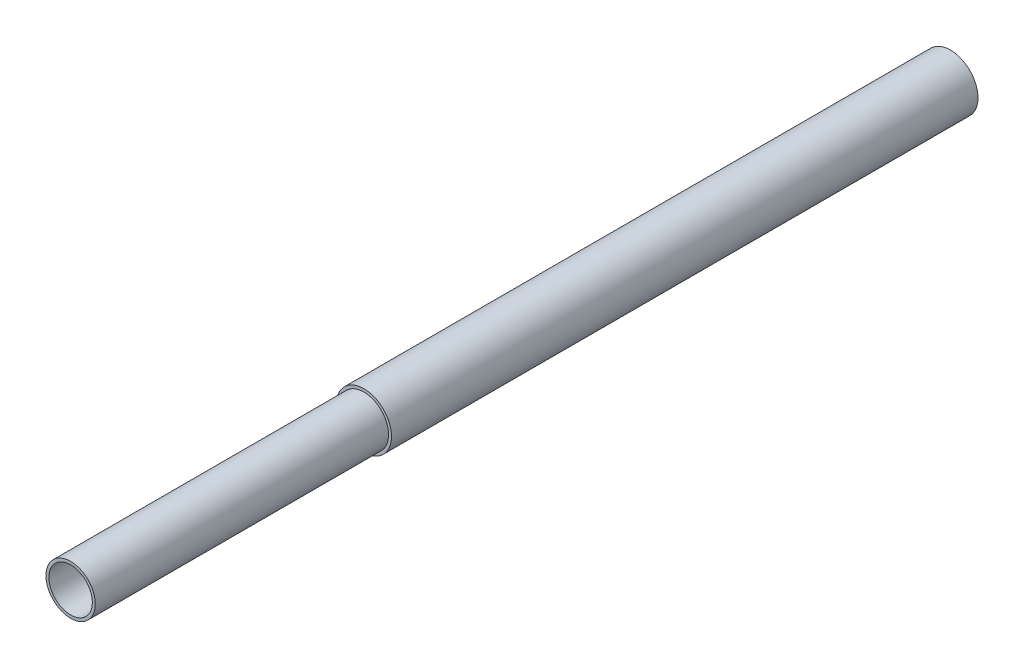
ISO-10303-21;
HEADER;
FILE_DESCRIPTION(('STEP AP214'),'2;1');
FILE_NAME('part.step','',(''),(''),'','','');
FILE_SCHEMA(('AUTOMOTIVE_DESIGN { 1 0 10303 214 1 1 1 1 }'));
ENDSEC;
DATA;
#1=APPLICATION_CONTEXT('core data for automotive mechanical design processes');
#2=APPLICATION_PROTOCOL_DEFINITION('international standard','automotive_design',2000,#1);
#3=PRODUCT_CONTEXT('',#1,'mechanical');
#4=PRODUCT('Part','Part','',(#3));
#5=PRODUCT_RELATED_PRODUCT_CATEGORY('part','',(#4));
#6=PRODUCT_DEFINITION_FORMATION('','',#4);
#7=PRODUCT_DEFINITION_CONTEXT('part definition',#1,'design');
#8=PRODUCT_DEFINITION('design','',#6,#7);
#9=PRODUCT_DEFINITION_SHAPE('','',#8);
#10=(LENGTH_UNIT() NAMED_UNIT(*) SI_UNIT(.MILLI.,.METRE.));
#11=(NAMED_UNIT(*) PLANE_ANGLE_UNIT() SI_UNIT($,.RADIAN.));
#12=(NAMED_UNIT(*) SI_UNIT($,.STERADIAN.) SOLID_ANGLE_UNIT());
#13=UNCERTAINTY_MEASURE_WITH_UNIT(LENGTH_MEASURE(1.E-05),#10,'distance_accuracy_value','');
#14=(GEOMETRIC_REPRESENTATION_CONTEXT(3) GLOBAL_UNCERTAINTY_ASSIGNED_CONTEXT((#13)) GLOBAL_UNIT_ASSIGNED_CONTEXT((#10,
#11,#12)) REPRESENTATION_CONTEXT('',''));
#15=CARTESIAN_POINT('',(0.,0.,0.));
#16=DIRECTION('',(0.,0.,1.));
#17=DIRECTION('',(1.,0.,0.));
#18=AXIS2_PLACEMENT_3D('',#15,#16,#17);
#19=CARTESIAN_POINT('',(0.,0.,50.8));
#20=DIRECTION('',(0.,0.,1.));
#21=DIRECTION('',(1.,0.,0.));
#22=AXIS2_PLACEMENT_3D('',#19,#20,#21);
#23=PLANE('',#22);
#24=CARTESIAN_POINT('',(0.,0.,50.8));
#25=DIRECTION('',(0.,0.,1.));
#26=DIRECTION('',(1.,0.,0.));
#27=AXIS2_PLACEMENT_3D('',#24,#25,#26);
#28=CIRCLE('',#27,2.39014);
#29=CARTESIAN_POINT('',(2.39014,0.,50.8));
#30=VERTEX_POINT('',#29);
#31=EDGE_CURVE('E10',#30,#30,#28,.T.);
#32=ORIENTED_EDGE('',*,*,#31,.T.);
#33=EDGE_LOOP('',(#32));
#34=FACE_BOUND('',#33,.T.);
#35=CARTESIAN_POINT('',(0.,0.,50.8));
#36=DIRECTION('',(0.,0.,1.));
#37=DIRECTION('',(1.,0.,0.));
#38=AXIS2_PLACEMENT_3D('',#35,#36,#37);
#39=CIRCLE('',#38,2.13614);
#40=CARTESIAN_POINT('',(2.13614,0.,50.8));
#41=VERTEX_POINT('',#40);
#42=EDGE_CURVE('E47',#41,#41,#39,.T.);
#43=ORIENTED_EDGE('',*,*,#42,.F.);
#44=EDGE_LOOP('',(#43));
#45=FACE_BOUND('',#44,.T.);
#46=ADVANCED_FACE('F34',(#34,#45),#23,.T.);
#47=CARTESIAN_POINT('',(0.,0.,50.8));
#48=DIRECTION('',(0.,0.,-1.));
#49=DIRECTION('',(-1.,0.,0.));
#50=AXIS2_PLACEMENT_3D('',#47,#48,#49);
#51=CYLINDRICAL_SURFACE('',#50,2.39014);
#52=ORIENTED_EDGE('',*,*,#31,.F.);
#53=EDGE_LOOP('',(#52));
#54=FACE_BOUND('',#53,.T.);
#55=CARTESIAN_POINT('',(0.,0.,0.));
#56=DIRECTION('',(0.,0.,1.));
#57=DIRECTION('',(1.,0.,0.));
#58=AXIS2_PLACEMENT_3D('',#55,#56,#57);
#59=CIRCLE('',#58,2.39014);
#60=CARTESIAN_POINT('',(2.39014,0.,0.));
#61=VERTEX_POINT('',#60);
#62=EDGE_CURVE('E38',#61,#61,#59,.T.);
#63=ORIENTED_EDGE('',*,*,#62,.T.);
#64=EDGE_LOOP('',(#63));
#65=FACE_BOUND('',#64,.T.);
#66=ADVANCED_FACE('F36',(#54,#65),#51,.T.);
#67=CARTESIAN_POINT('',(0.,0.,0.));
#68=DIRECTION('',(0.,0.,1.));
#69=DIRECTION('',(1.,0.,0.));
#70=AXIS2_PLACEMENT_3D('',#67,#68,#69);
#71=PLANE('',#70);
#72=ORIENTED_EDGE('',*,*,#62,.F.);
#73=EDGE_LOOP('',(#72));
#74=FACE_BOUND('',#73,.T.);
#75=ADVANCED_FACE('F76',(#74),#71,.F.);
#76=CARTESIAN_POINT('',(0.,0.,76.2));
#77=DIRECTION('',(0.,0.,-1.));
#78=DIRECTION('',(-1.,0.,0.));
#79=AXIS2_PLACEMENT_3D('',#76,#77,#78);
#80=CYLINDRICAL_SURFACE('',#79,2.13614);
#81=CARTESIAN_POINT('',(0.,0.,76.2));
#82=DIRECTION('',(0.,0.,1.));
#83=DIRECTION('',(1.,0.,0.));
#84=AXIS2_PLACEMENT_3D('',#81,#82,#83);
#85=CIRCLE('',#84,2.13614);
#86=CARTESIAN_POINT('',(2.13614,0.,76.2));
#87=VERTEX_POINT('',#86);
#88=EDGE_CURVE('E45',#87,#87,#85,.T.);
#89=ORIENTED_EDGE('',*,*,#88,.F.);
#90=EDGE_LOOP('',(#89));
#91=FACE_BOUND('',#90,.T.);
#92=ORIENTED_EDGE('',*,*,#42,.T.);
#93=EDGE_LOOP('',(#92));
#94=FACE_BOUND('',#93,.T.);
#95=ADVANCED_FACE('F70',(#91,#94),#80,.T.);
#96=CARTESIAN_POINT('',(0.,0.,76.2));
#97=DIRECTION('',(0.,0.,1.));
#98=DIRECTION('',(1.,0.,0.));
#99=AXIS2_PLACEMENT_3D('',#96,#97,#98);
#100=PLANE('',#99);
#101=CARTESIAN_POINT('',(0.,0.,76.2));
#102=DIRECTION('',(0.,0.,1.));
#103=DIRECTION('',(1.,0.,0.));
#104=AXIS2_PLACEMENT_3D('',#101,#102,#103);
#105=CIRCLE('',#104,1.88214);
#106=CARTESIAN_POINT('',(1.88214,0.,76.2));
#107=VERTEX_POINT('',#106);
#108=EDGE_CURVE('E53',#107,#107,#105,.T.);
#109=ORIENTED_EDGE('',*,*,#108,.F.);
#110=EDGE_LOOP('',(#109));
#111=FACE_BOUND('',#110,.T.);
#112=ORIENTED_EDGE('',*,*,#88,.T.);
#113=EDGE_LOOP('',(#112));
#114=FACE_BOUND('',#113,.T.);
#115=ADVANCED_FACE('F64',(#111,#114),#100,.T.);
#116=CARTESIAN_POINT('',(0.,0.,25.4));
#117=DIRECTION('',(0.,0.,1.));
#118=DIRECTION('',(1.,0.,0.));
#119=AXIS2_PLACEMENT_3D('',#116,#117,#118);
#120=CYLINDRICAL_SURFACE('',#119,1.88214);
#121=CARTESIAN_POINT('',(0.,0.,25.4));
#122=DIRECTION('',(0.,0.,1.));
#123=DIRECTION('',(1.,0.,0.));
#124=AXIS2_PLACEMENT_3D('',#121,#122,#123);
#125=CIRCLE('',#124,1.88214);
#126=CARTESIAN_POINT('',(1.88214,0.,25.4));
#127=VERTEX_POINT('',#126);
#128=EDGE_CURVE('E50',#127,#127,#125,.T.);
#129=ORIENTED_EDGE('',*,*,#128,.F.);
#130=EDGE_LOOP('',(#129));
#131=FACE_BOUND('',#130,.T.);
#132=ORIENTED_EDGE('',*,*,#108,.T.);
#133=EDGE_LOOP('',(#132));
#134=FACE_BOUND('',#133,.T.);
#135=ADVANCED_FACE('F61',(#131,#134),#120,.F.);
#136=CARTESIAN_POINT('',(0.,0.,25.4));
#137=DIRECTION('',(0.,0.,1.));
#138=DIRECTION('',(1.,0.,0.));
#139=AXIS2_PLACEMENT_3D('',#136,#137,#138);
#140=PLANE('',#139);
#141=ORIENTED_EDGE('',*,*,#128,.T.);
#142=EDGE_LOOP('',(#141));
#143=FACE_BOUND('',#142,.T.);
#144=ADVANCED_FACE('F59',(#143),#140,.T.);
#145=CLOSED_SHELL('',(#46,#66,#75,#95,#115,#135,#144));
#146=MANIFOLD_SOLID_BREP('B2',#145);
#147=ADVANCED_BREP_SHAPE_REPRESENTATION('',(#18,#146),#14);
#148=SHAPE_DEFINITION_REPRESENTATION(#9,#147);
ENDSEC;
END-ISO-10303-21;
